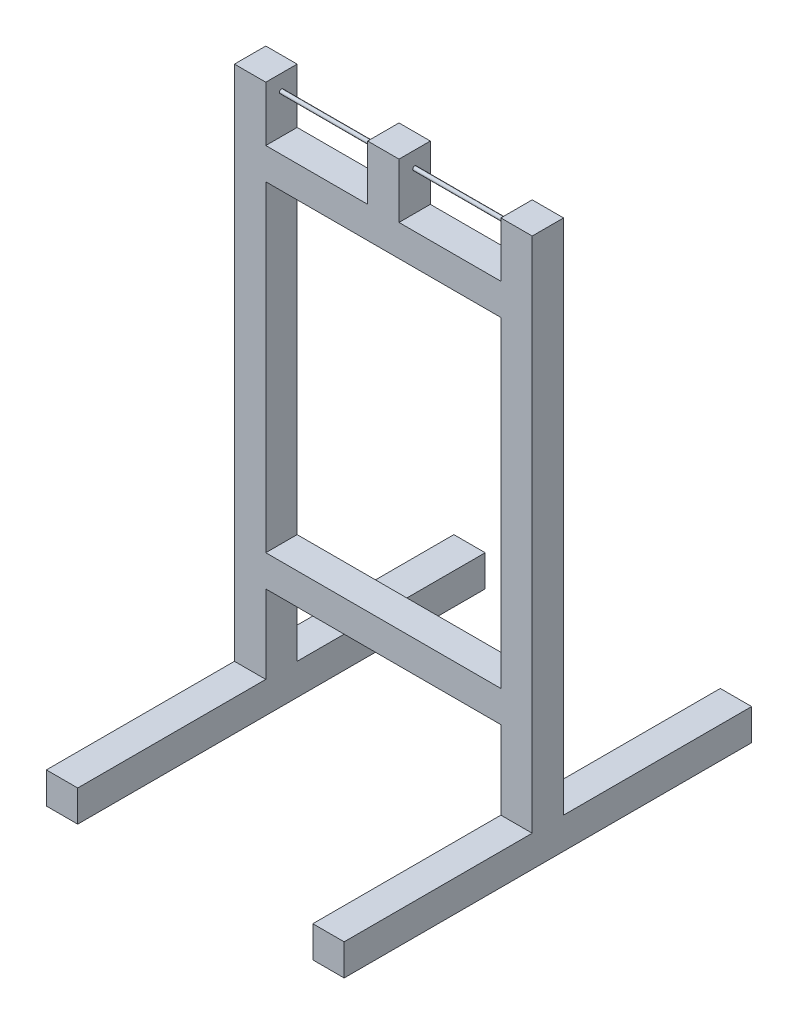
ISO-10303-21;
HEADER;
FILE_DESCRIPTION(('STEP AP214'),'2;1');
FILE_NAME('part.step','',(''),(''),'','','');
FILE_SCHEMA(('AUTOMOTIVE_DESIGN { 1 0 10303 214 1 1 1 1 }'));
ENDSEC;
DATA;
#1=APPLICATION_CONTEXT('core data for automotive mechanical design processes');
#2=APPLICATION_PROTOCOL_DEFINITION('international standard','automotive_design',2000,#1);
#3=PRODUCT_CONTEXT('',#1,'mechanical');
#4=PRODUCT('Part','Part','',(#3));
#5=PRODUCT_RELATED_PRODUCT_CATEGORY('part','',(#4));
#6=PRODUCT_DEFINITION_FORMATION('','',#4);
#7=PRODUCT_DEFINITION_CONTEXT('part definition',#1,'design');
#8=PRODUCT_DEFINITION('design','',#6,#7);
#9=PRODUCT_DEFINITION_SHAPE('','',#8);
#10=(LENGTH_UNIT() NAMED_UNIT(*) SI_UNIT(.MILLI.,.METRE.));
#11=(NAMED_UNIT(*) PLANE_ANGLE_UNIT() SI_UNIT($,.RADIAN.));
#12=(NAMED_UNIT(*) SI_UNIT($,.STERADIAN.) SOLID_ANGLE_UNIT());
#13=UNCERTAINTY_MEASURE_WITH_UNIT(LENGTH_MEASURE(1.E-05),#10,'distance_accuracy_value','');
#14=(GEOMETRIC_REPRESENTATION_CONTEXT(3) GLOBAL_UNCERTAINTY_ASSIGNED_CONTEXT((#13)) GLOBAL_UNIT_ASSIGNED_CONTEXT((#10,
#11,#12)) REPRESENTATION_CONTEXT('',''));
#15=CARTESIAN_POINT('',(0.,0.,0.));
#16=DIRECTION('',(0.,0.,1.));
#17=DIRECTION('',(1.,0.,0.));
#18=AXIS2_PLACEMENT_3D('',#15,#16,#17);
#19=CARTESIAN_POINT('',(500000.,387.35,165.1));
#20=DIRECTION('',(0.,-1.,0.));
#21=DIRECTION('',(0.,0.,-1.));
#22=AXIS2_PLACEMENT_3D('',#19,#20,#21);
#23=PLANE('',#22);
#24=DIRECTION('',(0.,0.,-1.));
#25=VECTOR('',#24,1.);
#26=CARTESIAN_POINT('',(120.65,387.35,12.7));
#27=LINE('',#26,#25);
#28=CARTESIAN_POINT('',(120.65,387.35,12.7));
#29=VERTEX_POINT('',#28);
#30=CARTESIAN_POINT('',(120.65,387.35,-12.7));
#31=VERTEX_POINT('',#30);
#32=EDGE_CURVE('E243',#29,#31,#27,.T.);
#33=ORIENTED_EDGE('',*,*,#32,.F.);
#34=DIRECTION('',(-1.,0.,0.));
#35=VECTOR('',#34,1.);
#36=CARTESIAN_POINT('',(500000.,387.35,12.7));
#37=LINE('',#36,#35);
#38=CARTESIAN_POINT('',(203.200000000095,387.35,12.7));
#39=VERTEX_POINT('',#38);
#40=EDGE_CURVE('E348',#39,#29,#37,.T.);
#41=ORIENTED_EDGE('',*,*,#40,.F.);
#42=DIRECTION('',(0.,0.,1.));
#43=VECTOR('',#42,1.);
#44=CARTESIAN_POINT('',(203.199999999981,387.35,165.1));
#45=LINE('',#44,#43);
#46=CARTESIAN_POINT('',(203.200000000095,387.35,-12.7));
#47=VERTEX_POINT('',#46);
#48=EDGE_CURVE('E356',#47,#39,#45,.T.);
#49=ORIENTED_EDGE('',*,*,#48,.F.);
#50=DIRECTION('',(-1.,0.,0.));
#51=VECTOR('',#50,1.);
#52=CARTESIAN_POINT('',(500000.,387.35,-12.7));
#53=LINE('',#52,#51);
#54=EDGE_CURVE('E344',#47,#31,#53,.T.);
#55=ORIENTED_EDGE('',*,*,#54,.T.);
#56=EDGE_LOOP('',(#33,#41,#49,#55));
#57=FACE_BOUND('',#56,.T.);
#58=ADVANCED_FACE('F33',(#57),#23,.F.);
#59=DIRECTION('',(0.,0.,1.));
#60=VECTOR('',#59,1.);
#61=CARTESIAN_POINT('',(95.25,387.35,12.7));
#62=LINE('',#61,#60);
#63=CARTESIAN_POINT('',(95.25,387.35,-12.7));
#64=VERTEX_POINT('',#63);
#65=CARTESIAN_POINT('',(95.2500000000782,387.35,12.7));
#66=VERTEX_POINT('',#65);
#67=EDGE_CURVE('E239',#64,#66,#62,.T.);
#68=ORIENTED_EDGE('',*,*,#67,.F.);
#69=CARTESIAN_POINT('',(12.7,387.35,-12.7));
#70=VERTEX_POINT('',#69);
#71=EDGE_CURVE('E347',#64,#70,#53,.T.);
#72=ORIENTED_EDGE('',*,*,#71,.T.);
#73=DIRECTION('',(0.,0.,1.));
#74=VECTOR('',#73,1.);
#75=CARTESIAN_POINT('',(12.7,387.35,165.1));
#76=LINE('',#75,#74);
#77=CARTESIAN_POINT('',(12.7,387.35,12.7));
#78=VERTEX_POINT('',#77);
#79=EDGE_CURVE('E336',#70,#78,#76,.T.);
#80=ORIENTED_EDGE('',*,*,#79,.T.);
#81=EDGE_CURVE('E346',#66,#78,#37,.T.);
#82=ORIENTED_EDGE('',*,*,#81,.F.);
#83=EDGE_LOOP('',(#68,#72,#80,#82));
#84=FACE_BOUND('',#83,.T.);
#85=ADVANCED_FACE('F448',(#84),#23,.F.);
#86=CARTESIAN_POINT('',(500000.,419.1,0.));
#87=DIRECTION('',(-1.,0.,0.));
#88=DIRECTION('',(0.,0.,1.));
#89=AXIS2_PLACEMENT_3D('',#86,#87,#88);
#90=CYLINDRICAL_SURFACE('',#89,1.5875);
#91=CARTESIAN_POINT('',(203.199999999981,419.1,0.));
#92=DIRECTION('',(1.,0.,0.));
#93=DIRECTION('',(0.,0.,-1.));
#94=AXIS2_PLACEMENT_3D('',#91,#92,#93);
#95=CIRCLE('',#94,1.5875);
#96=CARTESIAN_POINT('',(203.199999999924,419.1,1.5875));
#97=VERTEX_POINT('',#96);
#98=EDGE_CURVE('E426',#97,#97,#95,.F.);
#99=CARTESIAN_POINT('',(120.650000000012,419.1,0.));
#100=DIRECTION('',(-1.,0.,0.));
#101=DIRECTION('',(0.,0.,1.));
#102=AXIS2_PLACEMENT_3D('',#99,#100,#101);
#103=CIRCLE('',#102,1.5875);
#104=CARTESIAN_POINT('',(120.650000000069,419.1,1.5875));
#105=VERTEX_POINT('',#104);
#106=EDGE_CURVE('E11',#105,#105,#103,.T.);
#107=CARTESIAN_POINT('',(203.199999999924,419.1,1.5875));
#108=CARTESIAN_POINT('',(202.3401041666,419.1,1.5875));
#109=CARTESIAN_POINT('',(201.480208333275,419.1,1.5875));
#110=CARTESIAN_POINT('',(199.760416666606,419.1,1.5875));
#111=CARTESIAN_POINT('',(198.900520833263,419.1,1.5875));
#112=CARTESIAN_POINT('',(197.180729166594,419.1,1.5875));
#113=CARTESIAN_POINT('',(196.32083333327,419.1,1.5875));
#114=CARTESIAN_POINT('',(194.601041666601,419.1,1.5875));
#115=CARTESIAN_POINT('',(193.741145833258,419.1,1.5875));
#116=CARTESIAN_POINT('',(192.021354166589,419.1,1.5875));
#117=CARTESIAN_POINT('',(191.161458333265,419.1,1.5875));
#118=CARTESIAN_POINT('',(189.441666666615,419.1,1.5875));
#119=CARTESIAN_POINT('',(188.58177083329,419.1,1.5875));
#120=CARTESIAN_POINT('',(186.861979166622,419.1,1.5875));
#121=CARTESIAN_POINT('',(186.002083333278,419.1,1.5875));
#122=CARTESIAN_POINT('',(184.28229166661,419.1,1.5875));
#123=CARTESIAN_POINT('',(183.422395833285,419.1,1.5875));
#124=CARTESIAN_POINT('',(181.702604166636,419.1,1.5875));
#125=CARTESIAN_POINT('',(180.842708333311,419.1,1.5875));
#126=CARTESIAN_POINT('',(179.122916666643,419.1,1.5875));
#127=CARTESIAN_POINT('',(178.263020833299,419.1,1.5875));
#128=CARTESIAN_POINT('',(176.543229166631,419.1,1.5875));
#129=CARTESIAN_POINT('',(175.683333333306,419.1,1.5875));
#130=CARTESIAN_POINT('',(173.963541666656,419.1,1.5875));
#131=CARTESIAN_POINT('',(173.103645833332,419.1,1.5875));
#132=CARTESIAN_POINT('',(171.383854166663,419.1,1.5875));
#133=CARTESIAN_POINT('',(170.52395833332,419.1,1.5875));
#134=CARTESIAN_POINT('',(168.804166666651,419.1,1.5875));
#135=CARTESIAN_POINT('',(167.944270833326,419.1,1.5875));
#136=CARTESIAN_POINT('',(166.224479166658,419.1,1.5875));
#137=CARTESIAN_POINT('',(165.364583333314,419.1,1.5875));
#138=CARTESIAN_POINT('',(163.644791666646,419.1,1.5875));
#139=CARTESIAN_POINT('',(162.784895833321,419.1,1.5875));
#140=CARTESIAN_POINT('',(161.065104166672,419.1,1.5875));
#141=CARTESIAN_POINT('',(160.205208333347,419.1,1.5875));
#142=CARTESIAN_POINT('',(158.485416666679,419.1,1.5875));
#143=CARTESIAN_POINT('',(157.625520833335,419.1,1.5875));
#144=CARTESIAN_POINT('',(155.905729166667,419.1,1.5875));
#145=CARTESIAN_POINT('',(155.045833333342,419.1,1.5875));
#146=CARTESIAN_POINT('',(153.326041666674,419.1,1.5875));
#147=CARTESIAN_POINT('',(152.46614583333,419.1,1.5875));
#148=CARTESIAN_POINT('',(150.746354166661,419.1,1.5875));
#149=CARTESIAN_POINT('',(149.886458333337,419.1,1.5875));
#150=CARTESIAN_POINT('',(148.166666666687,419.1,1.5875));
#151=CARTESIAN_POINT('',(147.306770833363,419.1,1.5875));
#152=CARTESIAN_POINT('',(145.586979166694,419.1,1.5875));
#153=CARTESIAN_POINT('',(144.72708333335,419.1,1.5875));
#154=CARTESIAN_POINT('',(143.007291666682,419.1,1.5875));
#155=CARTESIAN_POINT('',(142.147395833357,419.1,1.5875));
#156=CARTESIAN_POINT('',(140.427604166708,419.1,1.5875));
#157=CARTESIAN_POINT('',(139.567708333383,419.1,1.5875));
#158=CARTESIAN_POINT('',(137.847916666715,419.1,1.5875));
#159=CARTESIAN_POINT('',(136.988020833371,419.1,1.5875));
#160=CARTESIAN_POINT('',(135.268229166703,419.1,1.5875));
#161=CARTESIAN_POINT('',(134.408333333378,419.1,1.5875));
#162=CARTESIAN_POINT('',(132.688541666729,419.1,1.5875));
#163=CARTESIAN_POINT('',(131.828645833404,419.1,1.5875));
#164=CARTESIAN_POINT('',(130.108854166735,419.1,1.5875));
#165=CARTESIAN_POINT('',(129.248958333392,419.1,1.5875));
#166=CARTESIAN_POINT('',(127.529166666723,419.1,1.5875));
#167=CARTESIAN_POINT('',(126.669270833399,419.1,1.5875));
#168=CARTESIAN_POINT('',(124.94947916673,419.1,1.5875));
#169=CARTESIAN_POINT('',(124.089583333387,419.1,1.5875));
#170=CARTESIAN_POINT('',(122.369791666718,419.1,1.5875));
#171=CARTESIAN_POINT('',(121.509895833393,419.1,1.5875));
#172=CARTESIAN_POINT('',(120.650000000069,419.1,1.5875));
#173=B_SPLINE_CURVE_WITH_KNOTS('',3,(#107,#108,#109,#110,#111,#112,#113,#114,#115,#116,#117,
#118,#119,#120,#121,#122,#123,#124,#125,#126,#127,#128,#129,#130,#131,#132,#133,#134,#135,#136,
#137,#138,#139,#140,#141,#142,#143,#144,#145,#146,#147,#148,#149,#150,#151,#152,#153,#154,#155,
#156,#157,#158,#159,#160,#161,#162,#163,#164,#165,#166,#167,#168,#169,#170,#171,#172),
.UNSPECIFIED.,.F.,.F.,(4,2,2,2,2,2,2,2,2,2,2,2,2,2,2,2,2,2,2,2,2,2,2,2,2,2,2,2,2,2,2,2,4),(0.,
2.57968749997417,5.15937500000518,7.73906249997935,10.3187500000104,12.8984374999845,
15.4781249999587,18.0578124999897,20.6374999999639,23.2171874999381,25.7968749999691,
28.3765624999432,30.9562499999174,33.5359374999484,36.1156249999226,38.6953124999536,
41.2749999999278,43.854687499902,46.434374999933,49.0140624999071,51.5937499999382,
54.1734374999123,56.7531249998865,59.3328124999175,61.9124999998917,64.4921874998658,
67.0718749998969,69.651562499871,72.2312499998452,74.8109374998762,77.3906249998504,
79.9703124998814,82.5499999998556),.UNSPECIFIED.);
#174=EDGE_CURVE('BSEAM437',#97,#105,#173,.T.);
#175=ORIENTED_EDGE('',*,*,#98,.T.);
#176=ORIENTED_EDGE('',*,*,#106,.F.);
#177=ORIENTED_EDGE('',*,*,#174,.T.);
#178=ORIENTED_EDGE('',*,*,#174,.F.);
#179=EDGE_LOOP('',(#175,#177,#176,#178));
#180=FACE_BOUND('',#179,.T.);
#181=ADVANCED_FACE('F437',(#180),#90,.T.);
#182=CARTESIAN_POINT('',(12.6999999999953,419.1,0.));
#183=DIRECTION('',(-1.,0.,0.));
#184=DIRECTION('',(0.,0.,1.));
#185=AXIS2_PLACEMENT_3D('',#182,#183,#184);
#186=CIRCLE('',#185,1.5875);
#187=CARTESIAN_POINT('',(12.6999999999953,419.1,1.5875));
#188=VERTEX_POINT('',#187);
#189=EDGE_CURVE('E423',#188,#188,#186,.F.);
#190=CARTESIAN_POINT('',(95.2500000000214,419.1,0.));
#191=DIRECTION('',(1.,0.,0.));
#192=DIRECTION('',(0.,0.,-1.));
#193=AXIS2_PLACEMENT_3D('',#190,#191,#192);
#194=CIRCLE('',#193,1.5875);
#195=CARTESIAN_POINT('',(95.2499999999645,419.1,1.5875));
#196=VERTEX_POINT('',#195);
#197=EDGE_CURVE('E41',#196,#196,#194,.T.);
#198=CARTESIAN_POINT('',(12.6999999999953,419.1,1.5875));
#199=CARTESIAN_POINT('',(13.55989583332,419.1,1.5875));
#200=CARTESIAN_POINT('',(14.4197916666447,419.1,1.5875));
#201=CARTESIAN_POINT('',(16.1395833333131,419.1,1.5875));
#202=CARTESIAN_POINT('',(16.9994791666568,419.1,1.5875));
#203=CARTESIAN_POINT('',(18.7192708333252,419.1,1.5875));
#204=CARTESIAN_POINT('',(19.5791666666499,419.1,1.5875));
#205=CARTESIAN_POINT('',(21.2989583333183,419.1,1.5875));
#206=CARTESIAN_POINT('',(22.158854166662,419.1,1.5875));
#207=CARTESIAN_POINT('',(23.8786458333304,419.1,1.5875));
#208=CARTESIAN_POINT('',(24.7385416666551,419.1,1.5875));
#209=CARTESIAN_POINT('',(26.4583333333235,419.1,1.5875));
#210=CARTESIAN_POINT('',(27.3182291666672,419.1,1.5875));
#211=CARTESIAN_POINT('',(29.0380208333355,419.1,1.5875));
#212=CARTESIAN_POINT('',(29.8979166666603,419.1,1.5875));
#213=CARTESIAN_POINT('',(31.6177083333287,419.1,1.5875));
#214=CARTESIAN_POINT('',(32.4776041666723,419.1,1.5875));
#215=CARTESIAN_POINT('',(34.1973958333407,419.1,1.5875));
#216=CARTESIAN_POINT('',(35.0572916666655,419.1,1.5875));
#217=CARTESIAN_POINT('',(36.7770833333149,419.1,1.5875));
#218=CARTESIAN_POINT('',(37.6369791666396,419.1,1.5875));
#219=CARTESIAN_POINT('',(39.356770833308,419.1,1.5875));
#220=CARTESIAN_POINT('',(40.2166666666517,419.1,1.5875));
#221=CARTESIAN_POINT('',(41.9364583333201,419.1,1.5875));
#222=CARTESIAN_POINT('',(42.7963541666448,419.1,1.5875));
#223=CARTESIAN_POINT('',(44.5161458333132,419.1,1.5875));
#224=CARTESIAN_POINT('',(45.3760416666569,419.1,1.5875));
#225=CARTESIAN_POINT('',(47.0958333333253,419.1,1.5875));
#226=CARTESIAN_POINT('',(47.95572916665,419.1,1.5875));
#227=CARTESIAN_POINT('',(49.6755208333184,419.1,1.5875));
#228=CARTESIAN_POINT('',(50.5354166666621,419.1,1.5875));
#229=CARTESIAN_POINT('',(52.2552083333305,419.1,1.5875));
#230=CARTESIAN_POINT('',(53.1151041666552,419.1,1.5875));
#231=CARTESIAN_POINT('',(54.8348958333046,419.1,1.5875));
#232=CARTESIAN_POINT('',(55.6947916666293,419.1,1.5875));
#233=CARTESIAN_POINT('',(57.4145833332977,419.1,1.5875));
#234=CARTESIAN_POINT('',(58.2744791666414,419.1,1.5875));
#235=CARTESIAN_POINT('',(59.9942708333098,419.1,1.5875));
#236=CARTESIAN_POINT('',(60.8541666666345,419.1,1.5875));
#237=CARTESIAN_POINT('',(62.5739583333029,419.1,1.5875));
#238=CARTESIAN_POINT('',(63.4338541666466,419.1,1.5875));
#239=CARTESIAN_POINT('',(65.153645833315,419.1,1.5875));
#240=CARTESIAN_POINT('',(66.0135416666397,419.1,1.5875));
#241=CARTESIAN_POINT('',(67.7333333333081,419.1,1.5875));
#242=CARTESIAN_POINT('',(68.5932291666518,419.1,1.5875));
#243=CARTESIAN_POINT('',(70.3130208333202,419.1,1.5875));
#244=CARTESIAN_POINT('',(71.1729166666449,419.1,1.5875));
#245=CARTESIAN_POINT('',(72.8927083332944,419.1,1.5875));
#246=CARTESIAN_POINT('',(73.7526041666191,419.1,1.5875));
#247=CARTESIAN_POINT('',(75.4723958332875,419.1,1.5875));
#248=CARTESIAN_POINT('',(76.3322916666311,419.1,1.5875));
#249=CARTESIAN_POINT('',(78.0520833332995,419.1,1.5875));
#250=CARTESIAN_POINT('',(78.9119791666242,419.1,1.5875));
#251=CARTESIAN_POINT('',(80.6317708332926,419.1,1.5875));
#252=CARTESIAN_POINT('',(81.4916666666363,419.1,1.5875));
#253=CARTESIAN_POINT('',(83.2114583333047,419.1,1.5875));
#254=CARTESIAN_POINT('',(84.0713541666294,419.1,1.5875));
#255=CARTESIAN_POINT('',(85.7911458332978,419.1,1.5875));
#256=CARTESIAN_POINT('',(86.6510416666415,419.1,1.5875));
#257=CARTESIAN_POINT('',(88.3708333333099,419.1,1.5875));
#258=CARTESIAN_POINT('',(89.2307291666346,419.1,1.5875));
#259=CARTESIAN_POINT('',(90.950520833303,419.1,1.5875));
#260=CARTESIAN_POINT('',(91.8104166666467,419.1,1.5875));
#261=CARTESIAN_POINT('',(93.5302083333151,419.1,1.5875));
#262=CARTESIAN_POINT('',(94.3901041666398,419.1,1.5875));
#263=CARTESIAN_POINT('',(95.2499999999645,419.1,1.5875));
#264=B_SPLINE_CURVE_WITH_KNOTS('',3,(#198,#199,#200,#201,#202,#203,#204,#205,#206,#207,#208,
#209,#210,#211,#212,#213,#214,#215,#216,#217,#218,#219,#220,#221,#222,#223,#224,#225,#226,#227,
#228,#229,#230,#231,#232,#233,#234,#235,#236,#237,#238,#239,#240,#241,#242,#243,#244,#245,#246,
#247,#248,#249,#250,#251,#252,#253,#254,#255,#256,#257,#258,#259,#260,#261,#262,#263),
.UNSPECIFIED.,.F.,.F.,(4,2,2,2,2,2,2,2,2,2,2,2,2,2,2,2,2,2,2,2,2,2,2,2,2,2,2,2,2,2,2,2,4),(0.,
2.57968749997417,5.15937500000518,7.73906249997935,10.3187500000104,12.8984374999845,
15.4781250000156,18.0578124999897,20.6375000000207,23.2171874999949,25.7968749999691,
28.3765625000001,30.9562499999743,33.5359375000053,36.1156249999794,38.6953125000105,
41.2749999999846,43.8546874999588,46.4343749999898,49.014062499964,51.593749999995,
54.1734374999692,56.7531250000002,59.3328124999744,61.9124999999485,64.4921874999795,
67.0718749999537,69.6515624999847,72.2312499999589,74.8109374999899,77.3906249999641,
79.9703124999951,82.5499999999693),.UNSPECIFIED.);
#265=EDGE_CURVE('BSEAM434',#188,#196,#264,.T.);
#266=ORIENTED_EDGE('',*,*,#189,.T.);
#267=ORIENTED_EDGE('',*,*,#197,.F.);
#268=ORIENTED_EDGE('',*,*,#265,.T.);
#269=ORIENTED_EDGE('',*,*,#265,.F.);
#270=EDGE_LOOP('',(#266,#268,#267,#269));
#271=FACE_BOUND('',#270,.T.);
#272=ADVANCED_FACE('F434',(#271),#90,.T.);
#273=CARTESIAN_POINT('',(203.2,-12.7,165.1));
#274=DIRECTION('',(1.,0.,0.));
#275=DIRECTION('',(0.,0.,-1.));
#276=AXIS2_PLACEMENT_3D('',#273,#274,#275);
#277=PLANE('',#276);
#278=DIRECTION('',(0.,0.,1.));
#279=VECTOR('',#278,1.);
#280=CARTESIAN_POINT('',(203.199999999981,101.6,165.1));
#281=LINE('',#280,#279);
#282=CARTESIAN_POINT('',(203.200000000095,101.6,-12.7));
#283=VERTEX_POINT('',#282);
#284=CARTESIAN_POINT('',(203.200000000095,101.6,12.7));
#285=VERTEX_POINT('',#284);
#286=EDGE_CURVE('E248',#283,#285,#281,.T.);
#287=ORIENTED_EDGE('',*,*,#286,.T.);
#288=DIRECTION('',(0.,-1.,0.));
#289=VECTOR('',#288,1.);
#290=CARTESIAN_POINT('',(203.2,431.8,12.7));
#291=LINE('',#290,#289);
#292=CARTESIAN_POINT('',(203.200000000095,361.95,12.7));
#293=VERTEX_POINT('',#292);
#294=EDGE_CURVE('E377',#293,#285,#291,.T.);
#295=ORIENTED_EDGE('',*,*,#294,.F.);
#296=DIRECTION('',(0.,0.,-1.));
#297=VECTOR('',#296,1.);
#298=CARTESIAN_POINT('',(203.199999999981,361.95,165.1));
#299=LINE('',#298,#297);
#300=CARTESIAN_POINT('',(203.2,361.95,-12.7));
#301=VERTEX_POINT('',#300);
#302=EDGE_CURVE('E335',#293,#301,#299,.T.);
#303=ORIENTED_EDGE('',*,*,#302,.T.);
#304=DIRECTION('',(0.,-1.,0.));
#305=VECTOR('',#304,1.);
#306=CARTESIAN_POINT('',(203.2,431.8,-12.7));
#307=LINE('',#306,#305);
#308=EDGE_CURVE('E382',#301,#283,#307,.T.);
#309=ORIENTED_EDGE('',*,*,#308,.T.);
#310=EDGE_LOOP('',(#287,#295,#303,#309));
#311=FACE_BOUND('',#310,.T.);
#312=ADVANCED_FACE('F436',(#311),#277,.F.);
#313=DIRECTION('',(0.,0.,-1.));
#314=VECTOR('',#313,1.);
#315=CARTESIAN_POINT('',(203.199999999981,76.2,165.1));
#316=LINE('',#315,#314);
#317=CARTESIAN_POINT('',(203.2,76.2,12.7));
#318=VERTEX_POINT('',#317);
#319=CARTESIAN_POINT('',(203.200000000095,76.2,-12.7));
#320=VERTEX_POINT('',#319);
#321=EDGE_CURVE('E245',#318,#320,#316,.T.);
#322=ORIENTED_EDGE('',*,*,#321,.T.);
#323=CARTESIAN_POINT('',(203.2,12.7,-12.7));
#324=VERTEX_POINT('',#323);
#325=EDGE_CURVE('E376',#320,#324,#307,.T.);
#326=ORIENTED_EDGE('',*,*,#325,.T.);
#327=DIRECTION('',(0.,0.,-1.));
#328=VECTOR('',#327,1.);
#329=CARTESIAN_POINT('',(203.2,12.7,165.1));
#330=LINE('',#329,#328);
#331=CARTESIAN_POINT('',(203.2,12.7,-165.1));
#332=VERTEX_POINT('',#331);
#333=EDGE_CURVE('E416',#324,#332,#330,.T.);
#334=ORIENTED_EDGE('',*,*,#333,.T.);
#335=DIRECTION('',(0.,-1.,0.));
#336=VECTOR('',#335,1.);
#337=CARTESIAN_POINT('',(203.2,-12.7,-165.1));
#338=LINE('',#337,#336);
#339=CARTESIAN_POINT('',(203.2,-12.7,-165.1));
#340=VERTEX_POINT('',#339);
#341=EDGE_CURVE('E408',#332,#340,#338,.T.);
#342=ORIENTED_EDGE('',*,*,#341,.T.);
#343=DIRECTION('',(0.,0.,-1.));
#344=VECTOR('',#343,1.);
#345=CARTESIAN_POINT('',(203.2,-12.7,165.1));
#346=LINE('',#345,#344);
#347=CARTESIAN_POINT('',(203.2,-12.7,165.1));
#348=VERTEX_POINT('',#347);
#349=EDGE_CURVE('E413',#348,#340,#346,.T.);
#350=ORIENTED_EDGE('',*,*,#349,.F.);
#351=DIRECTION('',(0.,-1.,0.));
#352=VECTOR('',#351,1.);
#353=CARTESIAN_POINT('',(203.2,-12.7,165.1));
#354=LINE('',#353,#352);
#355=CARTESIAN_POINT('',(203.2,12.7,165.1));
#356=VERTEX_POINT('',#355);
#357=EDGE_CURVE('E398',#356,#348,#354,.T.);
#358=ORIENTED_EDGE('',*,*,#357,.F.);
#359=CARTESIAN_POINT('',(203.2,12.7,12.7));
#360=VERTEX_POINT('',#359);
#361=EDGE_CURVE('E417',#356,#360,#330,.T.);
#362=ORIENTED_EDGE('',*,*,#361,.T.);
#363=EDGE_CURVE('E372',#318,#360,#291,.T.);
#364=ORIENTED_EDGE('',*,*,#363,.F.);
#365=EDGE_LOOP('',(#322,#326,#334,#342,#350,#358,#362,#364));
#366=FACE_BOUND('',#365,.T.);
#367=ADVANCED_FACE('F444',(#366),#277,.F.);
#368=ORIENTED_EDGE('',*,*,#98,.F.);
#369=EDGE_LOOP('',(#368));
#370=FACE_BOUND('',#369,.T.);
#371=CARTESIAN_POINT('',(203.2,431.8,-12.7));
#372=VERTEX_POINT('',#371);
#373=EDGE_CURVE('E378',#372,#47,#307,.T.);
#374=ORIENTED_EDGE('',*,*,#373,.T.);
#375=ORIENTED_EDGE('',*,*,#48,.T.);
#376=CARTESIAN_POINT('',(203.2,431.8,12.7));
#377=VERTEX_POINT('',#376);
#378=EDGE_CURVE('E373',#377,#39,#291,.T.);
#379=ORIENTED_EDGE('',*,*,#378,.F.);
#380=DIRECTION('',(0.,0.,1.));
#381=VECTOR('',#380,1.);
#382=CARTESIAN_POINT('',(203.2,431.8,12.7));
#383=LINE('',#382,#381);
#384=EDGE_CURVE('E365',#372,#377,#383,.T.);
#385=ORIENTED_EDGE('',*,*,#384,.F.);
#386=EDGE_LOOP('',(#374,#375,#379,#385));
#387=FACE_BOUND('',#386,.T.);
#388=ADVANCED_FACE('F447',(#370,#387),#277,.F.);
#389=CARTESIAN_POINT('',(203.2,12.7,165.1));
#390=DIRECTION('',(0.,-1.,0.));
#391=DIRECTION('',(0.,0.,-1.));
#392=AXIS2_PLACEMENT_3D('',#389,#390,#391);
#393=PLANE('',#392);
#394=DIRECTION('',(-1.,0.,0.));
#395=VECTOR('',#394,1.);
#396=CARTESIAN_POINT('',(203.2,12.7,-12.7));
#397=LINE('',#396,#395);
#398=CARTESIAN_POINT('',(228.6,12.7,-12.7));
#399=VERTEX_POINT('',#398);
#400=EDGE_CURVE('E388',#399,#324,#397,.T.);
#401=ORIENTED_EDGE('',*,*,#400,.F.);
#402=DIRECTION('',(0.,0.,-1.));
#403=VECTOR('',#402,1.);
#404=CARTESIAN_POINT('',(228.6,12.7,165.1));
#405=LINE('',#404,#403);
#406=CARTESIAN_POINT('',(228.6,12.7,-165.1));
#407=VERTEX_POINT('',#406);
#408=EDGE_CURVE('E420',#399,#407,#405,.T.);
#409=ORIENTED_EDGE('',*,*,#408,.T.);
#410=DIRECTION('',(-1.,0.,0.));
#411=VECTOR('',#410,1.);
#412=CARTESIAN_POINT('',(203.2,12.7,-165.1));
#413=LINE('',#412,#411);
#414=EDGE_CURVE('E405',#407,#332,#413,.T.);
#415=ORIENTED_EDGE('',*,*,#414,.T.);
#416=ORIENTED_EDGE('',*,*,#333,.F.);
#417=EDGE_LOOP('',(#401,#409,#415,#416));
#418=FACE_BOUND('',#417,.T.);
#419=ADVANCED_FACE('F488',(#418),#393,.F.);
#420=DIRECTION('',(1.,0.,0.));
#421=VECTOR('',#420,1.);
#422=CARTESIAN_POINT('',(203.2,12.7,12.7));
#423=LINE('',#422,#421);
#424=CARTESIAN_POINT('',(228.6,12.7,12.7));
#425=VERTEX_POINT('',#424);
#426=EDGE_CURVE('E385',#360,#425,#423,.T.);
#427=ORIENTED_EDGE('',*,*,#426,.F.);
#428=ORIENTED_EDGE('',*,*,#361,.F.);
#429=DIRECTION('',(-1.,0.,0.));
#430=VECTOR('',#429,1.);
#431=CARTESIAN_POINT('',(203.2,12.7,165.1));
#432=LINE('',#431,#430);
#433=CARTESIAN_POINT('',(228.6,12.7,165.1));
#434=VERTEX_POINT('',#433);
#435=EDGE_CURVE('E395',#434,#356,#432,.T.);
#436=ORIENTED_EDGE('',*,*,#435,.F.);
#437=EDGE_CURVE('E421',#434,#425,#405,.T.);
#438=ORIENTED_EDGE('',*,*,#437,.T.);
#439=EDGE_LOOP('',(#427,#428,#436,#438));
#440=FACE_BOUND('',#439,.T.);
#441=ADVANCED_FACE('F490',(#440),#393,.F.);
#442=CARTESIAN_POINT('',(228.6,-12.7,165.1));
#443=DIRECTION('',(-1.,0.,0.));
#444=DIRECTION('',(0.,0.,1.));
#445=AXIS2_PLACEMENT_3D('',#442,#443,#444);
#446=PLANE('',#445);
#447=ORIENTED_EDGE('',*,*,#408,.F.);
#448=DIRECTION('',(0.,-1.,0.));
#449=VECTOR('',#448,1.);
#450=CARTESIAN_POINT('',(228.6,431.8,-12.7));
#451=LINE('',#450,#449);
#452=CARTESIAN_POINT('',(228.6,431.8,-12.7));
#453=VERTEX_POINT('',#452);
#454=EDGE_CURVE('E381',#453,#399,#451,.T.);
#455=ORIENTED_EDGE('',*,*,#454,.F.);
#456=DIRECTION('',(0.,0.,-1.));
#457=VECTOR('',#456,1.);
#458=CARTESIAN_POINT('',(228.6,431.8,12.7));
#459=LINE('',#458,#457);
#460=CARTESIAN_POINT('',(228.6,431.8,12.7));
#461=VERTEX_POINT('',#460);
#462=EDGE_CURVE('E339',#461,#453,#459,.T.);
#463=ORIENTED_EDGE('',*,*,#462,.F.);
#464=DIRECTION('',(0.,-1.,0.));
#465=VECTOR('',#464,1.);
#466=CARTESIAN_POINT('',(228.6,431.8,12.7));
#467=LINE('',#466,#465);
#468=EDGE_CURVE('E369',#461,#425,#467,.T.);
#469=ORIENTED_EDGE('',*,*,#468,.T.);
#470=ORIENTED_EDGE('',*,*,#437,.F.);
#471=DIRECTION('',(0.,1.,0.));
#472=VECTOR('',#471,1.);
#473=CARTESIAN_POINT('',(228.6,-12.7,165.1));
#474=LINE('',#473,#472);
#475=CARTESIAN_POINT('',(228.6,-12.7,165.1));
#476=VERTEX_POINT('',#475);
#477=EDGE_CURVE('E392',#476,#434,#474,.T.);
#478=ORIENTED_EDGE('',*,*,#477,.F.);
#479=DIRECTION('',(0.,0.,-1.));
#480=VECTOR('',#479,1.);
#481=CARTESIAN_POINT('',(228.6,-12.7,165.1));
#482=LINE('',#481,#480);
#483=CARTESIAN_POINT('',(228.6,-12.7,-165.1));
#484=VERTEX_POINT('',#483);
#485=EDGE_CURVE('E402',#476,#484,#482,.T.);
#486=ORIENTED_EDGE('',*,*,#485,.T.);
#487=DIRECTION('',(0.,1.,0.));
#488=VECTOR('',#487,1.);
#489=CARTESIAN_POINT('',(228.6,-12.7,-165.1));
#490=LINE('',#489,#488);
#491=EDGE_CURVE('E391',#484,#407,#490,.T.);
#492=ORIENTED_EDGE('',*,*,#491,.T.);
#493=EDGE_LOOP('',(#447,#455,#463,#469,#470,#478,#486,#492));
#494=FACE_BOUND('',#493,.T.);
#495=ADVANCED_FACE('F35',(#494),#446,.F.);
#496=CARTESIAN_POINT('',(203.2,-12.7,165.1));
#497=DIRECTION('',(0.,1.,0.));
#498=DIRECTION('',(0.,0.,1.));
#499=AXIS2_PLACEMENT_3D('',#496,#497,#498);
#500=PLANE('',#499);
#501=DIRECTION('',(1.,0.,0.));
#502=VECTOR('',#501,1.);
#503=CARTESIAN_POINT('',(203.2,-12.7,-165.1));
#504=LINE('',#503,#502);
#505=EDGE_CURVE('E396',#340,#484,#504,.T.);
#506=ORIENTED_EDGE('',*,*,#505,.T.);
#507=ORIENTED_EDGE('',*,*,#485,.F.);
#508=DIRECTION('',(1.,0.,0.));
#509=VECTOR('',#508,1.);
#510=CARTESIAN_POINT('',(203.2,-12.7,165.1));
#511=LINE('',#510,#509);
#512=EDGE_CURVE('E400',#348,#476,#511,.T.);
#513=ORIENTED_EDGE('',*,*,#512,.F.);
#514=ORIENTED_EDGE('',*,*,#349,.T.);
#515=EDGE_LOOP('',(#506,#507,#513,#514));
#516=FACE_BOUND('',#515,.T.);
#517=ADVANCED_FACE('F481',(#516),#500,.F.);
#518=CARTESIAN_POINT('',(215.9,0.,165.1));
#519=DIRECTION('',(0.,0.,-1.));
#520=DIRECTION('',(-1.,0.,0.));
#521=AXIS2_PLACEMENT_3D('',#518,#519,#520);
#522=PLANE('',#521);
#523=ORIENTED_EDGE('',*,*,#477,.T.);
#524=ORIENTED_EDGE('',*,*,#435,.T.);
#525=ORIENTED_EDGE('',*,*,#357,.T.);
#526=ORIENTED_EDGE('',*,*,#512,.T.);
#527=EDGE_LOOP('',(#523,#524,#525,#526));
#528=FACE_BOUND('',#527,.T.);
#529=ADVANCED_FACE('F478',(#528),#522,.F.);
#530=CARTESIAN_POINT('',(215.9,0.,-165.1));
#531=DIRECTION('',(0.,0.,-1.));
#532=DIRECTION('',(-1.,0.,0.));
#533=AXIS2_PLACEMENT_3D('',#530,#531,#532);
#534=PLANE('',#533);
#535=ORIENTED_EDGE('',*,*,#491,.F.);
#536=ORIENTED_EDGE('',*,*,#505,.F.);
#537=ORIENTED_EDGE('',*,*,#341,.F.);
#538=ORIENTED_EDGE('',*,*,#414,.F.);
#539=EDGE_LOOP('',(#535,#536,#537,#538));
#540=FACE_BOUND('',#539,.T.);
#541=ADVANCED_FACE('F477',(#540),#534,.T.);
#542=CARTESIAN_POINT('',(203.2,431.8,-12.7));
#543=DIRECTION('',(0.,0.,1.));
#544=DIRECTION('',(1.,0.,0.));
#545=AXIS2_PLACEMENT_3D('',#542,#543,#544);
#546=PLANE('',#545);
#547=ORIENTED_EDGE('',*,*,#325,.F.);
#548=DIRECTION('',(-1.,0.,0.));
#549=VECTOR('',#548,1.);
#550=CARTESIAN_POINT('',(500000.,76.2,-12.7));
#551=LINE('',#550,#549);
#552=CARTESIAN_POINT('',(12.7,76.2,-12.7));
#553=VERTEX_POINT('',#552);
#554=EDGE_CURVE('E260',#320,#553,#551,.T.);
#555=ORIENTED_EDGE('',*,*,#554,.T.);
#556=DIRECTION('',(0.,-1.,0.));
#557=VECTOR('',#556,1.);
#558=CARTESIAN_POINT('',(12.7,431.8,-12.7));
#559=LINE('',#558,#557);
#560=CARTESIAN_POINT('',(12.7,12.7,-12.7));
#561=VERTEX_POINT('',#560);
#562=EDGE_CURVE('E291',#553,#561,#559,.T.);
#563=ORIENTED_EDGE('',*,*,#562,.T.);
#564=DIRECTION('',(-1.,0.,0.));
#565=VECTOR('',#564,1.);
#566=CARTESIAN_POINT('',(-12.7,12.7,-12.7));
#567=LINE('',#566,#565);
#568=CARTESIAN_POINT('',(-12.7,12.7,-12.7));
#569=VERTEX_POINT('',#568);
#570=EDGE_CURVE('E299',#561,#569,#567,.T.);
#571=ORIENTED_EDGE('',*,*,#570,.T.);
#572=DIRECTION('',(0.,-1.,0.));
#573=VECTOR('',#572,1.);
#574=CARTESIAN_POINT('',(-12.7,431.8,-12.7));
#575=LINE('',#574,#573);
#576=CARTESIAN_POINT('',(-12.7,431.8,-12.7));
#577=VERTEX_POINT('',#576);
#578=EDGE_CURVE('E288',#577,#569,#575,.T.);
#579=ORIENTED_EDGE('',*,*,#578,.F.);
#580=DIRECTION('',(-1.,0.,0.));
#581=VECTOR('',#580,1.);
#582=CARTESIAN_POINT('',(-12.7,431.8,-12.7));
#583=LINE('',#582,#581);
#584=CARTESIAN_POINT('',(12.7,431.8,-12.7));
#585=VERTEX_POINT('',#584);
#586=EDGE_CURVE('E274',#585,#577,#583,.T.);
#587=ORIENTED_EDGE('',*,*,#586,.F.);
#588=EDGE_CURVE('E292',#585,#70,#559,.T.);
#589=ORIENTED_EDGE('',*,*,#588,.T.);
#590=ORIENTED_EDGE('',*,*,#71,.F.);
#591=DIRECTION('',(0.,-1.,0.));
#592=VECTOR('',#591,1.);
#593=CARTESIAN_POINT('',(95.25,431.8,-12.7));
#594=LINE('',#593,#592);
#595=CARTESIAN_POINT('',(95.25,431.8,-12.7));
#596=VERTEX_POINT('',#595);
#597=EDGE_CURVE('E228',#596,#64,#594,.T.);
#598=ORIENTED_EDGE('',*,*,#597,.F.);
#599=DIRECTION('',(-1.,0.,0.));
#600=VECTOR('',#599,1.);
#601=CARTESIAN_POINT('',(95.25,431.8,-12.7));
#602=LINE('',#601,#600);
#603=CARTESIAN_POINT('',(120.65,431.8,-12.7));
#604=VERTEX_POINT('',#603);
#605=EDGE_CURVE('E218',#604,#596,#602,.T.);
#606=ORIENTED_EDGE('',*,*,#605,.F.);
#607=DIRECTION('',(0.,-1.,0.));
#608=VECTOR('',#607,1.);
#609=CARTESIAN_POINT('',(120.65,431.8,-12.7));
#610=LINE('',#609,#608);
#611=EDGE_CURVE('E225',#604,#31,#610,.T.);
#612=ORIENTED_EDGE('',*,*,#611,.T.);
#613=ORIENTED_EDGE('',*,*,#54,.F.);
#614=ORIENTED_EDGE('',*,*,#373,.F.);
#615=DIRECTION('',(-1.,0.,0.));
#616=VECTOR('',#615,1.);
#617=CARTESIAN_POINT('',(203.2,431.8,-12.7));
#618=LINE('',#617,#616);
#619=EDGE_CURVE('E363',#453,#372,#618,.T.);
#620=ORIENTED_EDGE('',*,*,#619,.F.);
#621=ORIENTED_EDGE('',*,*,#454,.T.);
#622=ORIENTED_EDGE('',*,*,#400,.T.);
#623=EDGE_LOOP('',(#547,#555,#563,#571,#579,#587,#589,#590,#598,#606,#612,#613,#614,#620,#621,#622));
#624=FACE_BOUND('',#623,.T.);
#625=DIRECTION('',(-1.,0.,0.));
#626=VECTOR('',#625,1.);
#627=CARTESIAN_POINT('',(500000.,101.6,-12.7));
#628=LINE('',#627,#626);
#629=CARTESIAN_POINT('',(12.7,101.6,-12.7));
#630=VERTEX_POINT('',#629);
#631=EDGE_CURVE('E261',#283,#630,#628,.T.);
#632=ORIENTED_EDGE('',*,*,#631,.F.);
#633=ORIENTED_EDGE('',*,*,#308,.F.);
#634=DIRECTION('',(-1.,0.,0.));
#635=VECTOR('',#634,1.);
#636=CARTESIAN_POINT('',(500000.,361.95,-12.7));
#637=LINE('',#636,#635);
#638=CARTESIAN_POINT('',(12.7,361.95,-12.7));
#639=VERTEX_POINT('',#638);
#640=EDGE_CURVE('E343',#301,#639,#637,.T.);
#641=ORIENTED_EDGE('',*,*,#640,.T.);
#642=EDGE_CURVE('E296',#639,#630,#559,.T.);
#643=ORIENTED_EDGE('',*,*,#642,.T.);
#644=EDGE_LOOP('',(#632,#633,#641,#643));
#645=FACE_BOUND('',#644,.T.);
#646=ADVANCED_FACE('F221',(#624,#645),#546,.F.);
#647=CARTESIAN_POINT('',(203.2,431.8,12.7));
#648=DIRECTION('',(0.,0.,-1.));
#649=DIRECTION('',(-1.,0.,0.));
#650=AXIS2_PLACEMENT_3D('',#647,#648,#649);
#651=PLANE('',#650);
#652=DIRECTION('',(-1.,0.,0.));
#653=VECTOR('',#652,1.);
#654=CARTESIAN_POINT('',(500000.,76.2,12.7));
#655=LINE('',#654,#653);
#656=CARTESIAN_POINT('',(12.7,76.2,12.7));
#657=VERTEX_POINT('',#656);
#658=EDGE_CURVE('E55',#318,#657,#655,.T.);
#659=ORIENTED_EDGE('',*,*,#658,.F.);
#660=ORIENTED_EDGE('',*,*,#363,.T.);
#661=ORIENTED_EDGE('',*,*,#426,.T.);
#662=ORIENTED_EDGE('',*,*,#468,.F.);
#663=DIRECTION('',(1.,0.,0.));
#664=VECTOR('',#663,1.);
#665=CARTESIAN_POINT('',(203.2,431.8,12.7));
#666=LINE('',#665,#664);
#667=EDGE_CURVE('E367',#377,#461,#666,.T.);
#668=ORIENTED_EDGE('',*,*,#667,.F.);
#669=ORIENTED_EDGE('',*,*,#378,.T.);
#670=ORIENTED_EDGE('',*,*,#40,.T.);
#671=DIRECTION('',(0.,-1.,0.));
#672=VECTOR('',#671,1.);
#673=CARTESIAN_POINT('',(120.65,431.8,12.7));
#674=LINE('',#673,#672);
#675=CARTESIAN_POINT('',(120.65,431.8,12.7));
#676=VERTEX_POINT('',#675);
#677=EDGE_CURVE('E576',#676,#29,#674,.T.);
#678=ORIENTED_EDGE('',*,*,#677,.F.);
#679=DIRECTION('',(1.,0.,0.));
#680=VECTOR('',#679,1.);
#681=CARTESIAN_POINT('',(95.25,431.8,12.7));
#682=LINE('',#681,#680);
#683=CARTESIAN_POINT('',(95.25,431.8,12.7));
#684=VERTEX_POINT('',#683);
#685=EDGE_CURVE('E236',#684,#676,#682,.T.);
#686=ORIENTED_EDGE('',*,*,#685,.F.);
#687=DIRECTION('',(0.,-1.,0.));
#688=VECTOR('',#687,1.);
#689=CARTESIAN_POINT('',(95.25,431.8,12.7));
#690=LINE('',#689,#688);
#691=EDGE_CURVE('E48',#684,#66,#690,.T.);
#692=ORIENTED_EDGE('',*,*,#691,.T.);
#693=ORIENTED_EDGE('',*,*,#81,.T.);
#694=DIRECTION('',(0.,-1.,0.));
#695=VECTOR('',#694,1.);
#696=CARTESIAN_POINT('',(12.7,431.8,12.7));
#697=LINE('',#696,#695);
#698=CARTESIAN_POINT('',(12.7,431.8,12.7));
#699=VERTEX_POINT('',#698);
#700=EDGE_CURVE('E281',#699,#78,#697,.T.);
#701=ORIENTED_EDGE('',*,*,#700,.F.);
#702=DIRECTION('',(1.,0.,0.));
#703=VECTOR('',#702,1.);
#704=CARTESIAN_POINT('',(-12.7,431.8,12.7));
#705=LINE('',#704,#703);
#706=CARTESIAN_POINT('',(-12.7,431.8,12.7));
#707=VERTEX_POINT('',#706);
#708=EDGE_CURVE('E278',#707,#699,#705,.T.);
#709=ORIENTED_EDGE('',*,*,#708,.F.);
#710=DIRECTION('',(0.,-1.,0.));
#711=VECTOR('',#710,1.);
#712=CARTESIAN_POINT('',(-12.7,431.8,12.7));
#713=LINE('',#712,#711);
#714=CARTESIAN_POINT('',(-12.7,12.7,12.7));
#715=VERTEX_POINT('',#714);
#716=EDGE_CURVE('E284',#707,#715,#713,.T.);
#717=ORIENTED_EDGE('',*,*,#716,.T.);
#718=DIRECTION('',(1.,0.,0.));
#719=VECTOR('',#718,1.);
#720=CARTESIAN_POINT('',(-12.7,12.7,12.7));
#721=LINE('',#720,#719);
#722=CARTESIAN_POINT('',(12.7,12.7,12.7));
#723=VERTEX_POINT('',#722);
#724=EDGE_CURVE('E295',#715,#723,#721,.T.);
#725=ORIENTED_EDGE('',*,*,#724,.T.);
#726=EDGE_CURVE('E280',#657,#723,#697,.T.);
#727=ORIENTED_EDGE('',*,*,#726,.F.);
#728=EDGE_LOOP('',(#659,#660,#661,#662,#668,#669,#670,#678,#686,#692,#693,#701,#709,#717,#725,#727));
#729=FACE_BOUND('',#728,.T.);
#730=ORIENTED_EDGE('',*,*,#294,.T.);
#731=DIRECTION('',(-1.,0.,0.));
#732=VECTOR('',#731,1.);
#733=CARTESIAN_POINT('',(500000.,101.6,12.7));
#734=LINE('',#733,#732);
#735=CARTESIAN_POINT('',(12.7,101.6,12.7));
#736=VERTEX_POINT('',#735);
#737=EDGE_CURVE('E264',#285,#736,#734,.T.);
#738=ORIENTED_EDGE('',*,*,#737,.T.);
#739=CARTESIAN_POINT('',(12.7,361.95,12.7));
#740=VERTEX_POINT('',#739);
#741=EDGE_CURVE('E285',#740,#736,#697,.T.);
#742=ORIENTED_EDGE('',*,*,#741,.F.);
#743=DIRECTION('',(-1.,0.,0.));
#744=VECTOR('',#743,1.);
#745=CARTESIAN_POINT('',(500000.,361.95,12.7));
#746=LINE('',#745,#744);
#747=EDGE_CURVE('E351',#293,#740,#746,.T.);
#748=ORIENTED_EDGE('',*,*,#747,.F.);
#749=EDGE_LOOP('',(#730,#738,#742,#748));
#750=FACE_BOUND('',#749,.T.);
#751=ADVANCED_FACE('F471',(#729,#750),#651,.F.);
#752=CARTESIAN_POINT('',(215.9,431.8,0.));
#753=DIRECTION('',(0.,-1.,0.));
#754=DIRECTION('',(0.,0.,-1.));
#755=AXIS2_PLACEMENT_3D('',#752,#753,#754);
#756=PLANE('',#755);
#757=ORIENTED_EDGE('',*,*,#462,.T.);
#758=ORIENTED_EDGE('',*,*,#619,.T.);
#759=ORIENTED_EDGE('',*,*,#384,.T.);
#760=ORIENTED_EDGE('',*,*,#667,.T.);
#761=EDGE_LOOP('',(#757,#758,#759,#760));
#762=FACE_BOUND('',#761,.T.);
#763=ADVANCED_FACE('F467',(#762),#756,.F.);
#764=CARTESIAN_POINT('',(500000.,361.95,165.1));
#765=DIRECTION('',(0.,1.,0.));
#766=DIRECTION('',(0.,0.,1.));
#767=AXIS2_PLACEMENT_3D('',#764,#765,#766);
#768=PLANE('',#767);
#769=ORIENTED_EDGE('',*,*,#302,.F.);
#770=ORIENTED_EDGE('',*,*,#747,.T.);
#771=DIRECTION('',(0.,0.,-1.));
#772=VECTOR('',#771,1.);
#773=CARTESIAN_POINT('',(12.7,361.95,165.1));
#774=LINE('',#773,#772);
#775=EDGE_CURVE('E340',#740,#639,#774,.T.);
#776=ORIENTED_EDGE('',*,*,#775,.T.);
#777=ORIENTED_EDGE('',*,*,#640,.F.);
#778=EDGE_LOOP('',(#769,#770,#776,#777));
#779=FACE_BOUND('',#778,.T.);
#780=ADVANCED_FACE('F463',(#779),#768,.F.);
#781=CARTESIAN_POINT('',(12.7,-12.7,165.1));
#782=DIRECTION('',(-1.,0.,0.));
#783=DIRECTION('',(0.,0.,1.));
#784=AXIS2_PLACEMENT_3D('',#781,#782,#783);
#785=PLANE('',#784);
#786=ORIENTED_EDGE('',*,*,#189,.F.);
#787=EDGE_LOOP('',(#786));
#788=FACE_BOUND('',#787,.T.);
#789=ORIENTED_EDGE('',*,*,#700,.T.);
#790=ORIENTED_EDGE('',*,*,#79,.F.);
#791=ORIENTED_EDGE('',*,*,#588,.F.);
#792=DIRECTION('',(0.,0.,-1.));
#793=VECTOR('',#792,1.);
#794=CARTESIAN_POINT('',(12.7,431.8,12.7));
#795=LINE('',#794,#793);
#796=EDGE_CURVE('E256',#699,#585,#795,.T.);
#797=ORIENTED_EDGE('',*,*,#796,.F.);
#798=EDGE_LOOP('',(#789,#790,#791,#797));
#799=FACE_BOUND('',#798,.T.);
#800=ADVANCED_FACE('F466',(#788,#799),#785,.F.);
#801=ORIENTED_EDGE('',*,*,#642,.F.);
#802=ORIENTED_EDGE('',*,*,#775,.F.);
#803=ORIENTED_EDGE('',*,*,#741,.T.);
#804=DIRECTION('',(0.,0.,1.));
#805=VECTOR('',#804,1.);
#806=CARTESIAN_POINT('',(12.7,101.6,165.1));
#807=LINE('',#806,#805);
#808=EDGE_CURVE('E253',#630,#736,#807,.T.);
#809=ORIENTED_EDGE('',*,*,#808,.F.);
#810=EDGE_LOOP('',(#801,#802,#803,#809));
#811=FACE_BOUND('',#810,.T.);
#812=ADVANCED_FACE('F533',(#811),#785,.F.);
#813=DIRECTION('',(0.,0.,-1.));
#814=VECTOR('',#813,1.);
#815=CARTESIAN_POINT('',(12.7,76.2,165.1));
#816=LINE('',#815,#814);
#817=EDGE_CURVE('E257',#657,#553,#816,.T.);
#818=ORIENTED_EDGE('',*,*,#817,.F.);
#819=ORIENTED_EDGE('',*,*,#726,.T.);
#820=DIRECTION('',(0.,0.,-1.));
#821=VECTOR('',#820,1.);
#822=CARTESIAN_POINT('',(12.7,12.7,165.1));
#823=LINE('',#822,#821);
#824=CARTESIAN_POINT('',(12.7,12.7,165.1));
#825=VERTEX_POINT('',#824);
#826=EDGE_CURVE('E332',#825,#723,#823,.T.);
#827=ORIENTED_EDGE('',*,*,#826,.F.);
#828=DIRECTION('',(0.,1.,0.));
#829=VECTOR('',#828,1.);
#830=CARTESIAN_POINT('',(12.7,-12.7,165.1));
#831=LINE('',#830,#829);
#832=CARTESIAN_POINT('',(12.7,-12.7,165.1));
#833=VERTEX_POINT('',#832);
#834=EDGE_CURVE('E303',#833,#825,#831,.T.);
#835=ORIENTED_EDGE('',*,*,#834,.F.);
#836=DIRECTION('',(0.,0.,-1.));
#837=VECTOR('',#836,1.);
#838=CARTESIAN_POINT('',(12.7,-12.7,165.1));
#839=LINE('',#838,#837);
#840=CARTESIAN_POINT('',(12.7,-12.7,-165.1));
#841=VERTEX_POINT('',#840);
#842=EDGE_CURVE('E313',#833,#841,#839,.T.);
#843=ORIENTED_EDGE('',*,*,#842,.T.);
#844=DIRECTION('',(0.,1.,0.));
#845=VECTOR('',#844,1.);
#846=CARTESIAN_POINT('',(12.7,-12.7,-165.1));
#847=LINE('',#846,#845);
#848=CARTESIAN_POINT('',(12.7,12.7,-165.1));
#849=VERTEX_POINT('',#848);
#850=EDGE_CURVE('E302',#841,#849,#847,.T.);
#851=ORIENTED_EDGE('',*,*,#850,.T.);
#852=EDGE_CURVE('E331',#561,#849,#823,.T.);
#853=ORIENTED_EDGE('',*,*,#852,.F.);
#854=ORIENTED_EDGE('',*,*,#562,.F.);
#855=EDGE_LOOP('',(#818,#819,#827,#835,#843,#851,#853,#854));
#856=FACE_BOUND('',#855,.T.);
#857=ADVANCED_FACE('F461',(#856),#785,.F.);
#858=CARTESIAN_POINT('',(-12.7,12.7,165.1));
#859=DIRECTION('',(0.,-1.,0.));
#860=DIRECTION('',(0.,0.,-1.));
#861=AXIS2_PLACEMENT_3D('',#858,#859,#860);
#862=PLANE('',#861);
#863=ORIENTED_EDGE('',*,*,#570,.F.);
#864=ORIENTED_EDGE('',*,*,#852,.T.);
#865=DIRECTION('',(-1.,0.,0.));
#866=VECTOR('',#865,1.);
#867=CARTESIAN_POINT('',(-12.7,12.7,-165.1));
#868=LINE('',#867,#866);
#869=CARTESIAN_POINT('',(-12.7,12.7,-165.1));
#870=VERTEX_POINT('',#869);
#871=EDGE_CURVE('E316',#849,#870,#868,.T.);
#872=ORIENTED_EDGE('',*,*,#871,.T.);
#873=DIRECTION('',(0.,0.,-1.));
#874=VECTOR('',#873,1.);
#875=CARTESIAN_POINT('',(-12.7,12.7,165.1));
#876=LINE('',#875,#874);
#877=EDGE_CURVE('E327',#569,#870,#876,.T.);
#878=ORIENTED_EDGE('',*,*,#877,.F.);
#879=EDGE_LOOP('',(#863,#864,#872,#878));
#880=FACE_BOUND('',#879,.T.);
#881=ADVANCED_FACE('F539',(#880),#862,.F.);
#882=ORIENTED_EDGE('',*,*,#724,.F.);
#883=CARTESIAN_POINT('',(-12.7,12.7,165.1));
#884=VERTEX_POINT('',#883);
#885=EDGE_CURVE('E328',#884,#715,#876,.T.);
#886=ORIENTED_EDGE('',*,*,#885,.F.);
#887=DIRECTION('',(-1.,0.,0.));
#888=VECTOR('',#887,1.);
#889=CARTESIAN_POINT('',(-12.7,12.7,165.1));
#890=LINE('',#889,#888);
#891=EDGE_CURVE('E306',#825,#884,#890,.T.);
#892=ORIENTED_EDGE('',*,*,#891,.F.);
#893=ORIENTED_EDGE('',*,*,#826,.T.);
#894=EDGE_LOOP('',(#882,#886,#892,#893));
#895=FACE_BOUND('',#894,.T.);
#896=ADVANCED_FACE('F607',(#895),#862,.F.);
#897=CARTESIAN_POINT('',(-12.7,-12.7,165.1));
#898=DIRECTION('',(1.,0.,0.));
#899=DIRECTION('',(0.,0.,-1.));
#900=AXIS2_PLACEMENT_3D('',#897,#898,#899);
#901=PLANE('',#900);
#902=ORIENTED_EDGE('',*,*,#885,.T.);
#903=ORIENTED_EDGE('',*,*,#716,.F.);
#904=DIRECTION('',(0.,0.,1.));
#905=VECTOR('',#904,1.);
#906=CARTESIAN_POINT('',(-12.7,431.8,12.7));
#907=LINE('',#906,#905);
#908=EDGE_CURVE('E276',#577,#707,#907,.T.);
#909=ORIENTED_EDGE('',*,*,#908,.F.);
#910=ORIENTED_EDGE('',*,*,#578,.T.);
#911=ORIENTED_EDGE('',*,*,#877,.T.);
#912=DIRECTION('',(0.,-1.,0.));
#913=VECTOR('',#912,1.);
#914=CARTESIAN_POINT('',(-12.7,-12.7,-165.1));
#915=LINE('',#914,#913);
#916=CARTESIAN_POINT('',(-12.7,-12.7,-165.1));
#917=VERTEX_POINT('',#916);
#918=EDGE_CURVE('E319',#870,#917,#915,.T.);
#919=ORIENTED_EDGE('',*,*,#918,.T.);
#920=DIRECTION('',(0.,0.,-1.));
#921=VECTOR('',#920,1.);
#922=CARTESIAN_POINT('',(-12.7,-12.7,165.1));
#923=LINE('',#922,#921);
#924=CARTESIAN_POINT('',(-12.7,-12.7,165.1));
#925=VERTEX_POINT('',#924);
#926=EDGE_CURVE('E324',#925,#917,#923,.T.);
#927=ORIENTED_EDGE('',*,*,#926,.F.);
#928=DIRECTION('',(0.,-1.,0.));
#929=VECTOR('',#928,1.);
#930=CARTESIAN_POINT('',(-12.7,-12.7,165.1));
#931=LINE('',#930,#929);
#932=EDGE_CURVE('E309',#884,#925,#931,.T.);
#933=ORIENTED_EDGE('',*,*,#932,.F.);
#934=EDGE_LOOP('',(#902,#903,#909,#910,#911,#919,#927,#933));
#935=FACE_BOUND('',#934,.T.);
#936=ADVANCED_FACE('F550',(#935),#901,.F.);
#937=CARTESIAN_POINT('',(-12.7,-12.7,165.1));
#938=DIRECTION('',(0.,1.,0.));
#939=DIRECTION('',(0.,0.,1.));
#940=AXIS2_PLACEMENT_3D('',#937,#938,#939);
#941=PLANE('',#940);
#942=DIRECTION('',(1.,0.,0.));
#943=VECTOR('',#942,1.);
#944=CARTESIAN_POINT('',(-12.7,-12.7,-165.1));
#945=LINE('',#944,#943);
#946=EDGE_CURVE('E307',#917,#841,#945,.T.);
#947=ORIENTED_EDGE('',*,*,#946,.T.);
#948=ORIENTED_EDGE('',*,*,#842,.F.);
#949=DIRECTION('',(1.,0.,0.));
#950=VECTOR('',#949,1.);
#951=CARTESIAN_POINT('',(-12.7,-12.7,165.1));
#952=LINE('',#951,#950);
#953=EDGE_CURVE('E311',#925,#833,#952,.T.);
#954=ORIENTED_EDGE('',*,*,#953,.F.);
#955=ORIENTED_EDGE('',*,*,#926,.T.);
#956=EDGE_LOOP('',(#947,#948,#954,#955));
#957=FACE_BOUND('',#956,.T.);
#958=ADVANCED_FACE('F554',(#957),#941,.F.);
#959=CARTESIAN_POINT('',(0.,0.,165.1));
#960=DIRECTION('',(0.,0.,-1.));
#961=DIRECTION('',(-1.,0.,0.));
#962=AXIS2_PLACEMENT_3D('',#959,#960,#961);
#963=PLANE('',#962);
#964=ORIENTED_EDGE('',*,*,#834,.T.);
#965=ORIENTED_EDGE('',*,*,#891,.T.);
#966=ORIENTED_EDGE('',*,*,#932,.T.);
#967=ORIENTED_EDGE('',*,*,#953,.T.);
#968=EDGE_LOOP('',(#964,#965,#966,#967));
#969=FACE_BOUND('',#968,.T.);
#970=ADVANCED_FACE('F556',(#969),#963,.F.);
#971=CARTESIAN_POINT('',(0.,0.,-165.1));
#972=DIRECTION('',(0.,0.,-1.));
#973=DIRECTION('',(-1.,0.,0.));
#974=AXIS2_PLACEMENT_3D('',#971,#972,#973);
#975=PLANE('',#974);
#976=ORIENTED_EDGE('',*,*,#850,.F.);
#977=ORIENTED_EDGE('',*,*,#946,.F.);
#978=ORIENTED_EDGE('',*,*,#918,.F.);
#979=ORIENTED_EDGE('',*,*,#871,.F.);
#980=EDGE_LOOP('',(#976,#977,#978,#979));
#981=FACE_BOUND('',#980,.T.);
#982=ADVANCED_FACE('F546',(#981),#975,.T.);
#983=CARTESIAN_POINT('',(0.,431.8,0.));
#984=DIRECTION('',(0.,-1.,0.));
#985=DIRECTION('',(0.,0.,-1.));
#986=AXIS2_PLACEMENT_3D('',#983,#984,#985);
#987=PLANE('',#986);
#988=ORIENTED_EDGE('',*,*,#796,.T.);
#989=ORIENTED_EDGE('',*,*,#586,.T.);
#990=ORIENTED_EDGE('',*,*,#908,.T.);
#991=ORIENTED_EDGE('',*,*,#708,.T.);
#992=EDGE_LOOP('',(#988,#989,#990,#991));
#993=FACE_BOUND('',#992,.T.);
#994=ADVANCED_FACE('F566',(#993),#987,.F.);
#995=CARTESIAN_POINT('',(500000.,101.6,165.1));
#996=DIRECTION('',(0.,-1.,0.));
#997=DIRECTION('',(0.,0.,-1.));
#998=AXIS2_PLACEMENT_3D('',#995,#996,#997);
#999=PLANE('',#998);
#1000=ORIENTED_EDGE('',*,*,#286,.F.);
#1001=ORIENTED_EDGE('',*,*,#631,.T.);
#1002=ORIENTED_EDGE('',*,*,#808,.T.);
#1003=ORIENTED_EDGE('',*,*,#737,.F.);
#1004=EDGE_LOOP('',(#1000,#1001,#1002,#1003));
#1005=FACE_BOUND('',#1004,.T.);
#1006=ADVANCED_FACE('F529',(#1005),#999,.F.);
#1007=CARTESIAN_POINT('',(500000.,76.2,165.1));
#1008=DIRECTION('',(0.,1.,0.));
#1009=DIRECTION('',(0.,0.,1.));
#1010=AXIS2_PLACEMENT_3D('',#1007,#1008,#1009);
#1011=PLANE('',#1010);
#1012=ORIENTED_EDGE('',*,*,#321,.F.);
#1013=ORIENTED_EDGE('',*,*,#658,.T.);
#1014=ORIENTED_EDGE('',*,*,#817,.T.);
#1015=ORIENTED_EDGE('',*,*,#554,.F.);
#1016=EDGE_LOOP('',(#1012,#1013,#1014,#1015));
#1017=FACE_BOUND('',#1016,.T.);
#1018=ADVANCED_FACE('F587',(#1017),#1011,.F.);
#1019=CARTESIAN_POINT('',(120.65,431.8,12.7));
#1020=DIRECTION('',(-1.,0.,0.));
#1021=DIRECTION('',(0.,0.,1.));
#1022=AXIS2_PLACEMENT_3D('',#1019,#1020,#1021);
#1023=PLANE('',#1022);
#1024=ORIENTED_EDGE('',*,*,#106,.T.);
#1025=EDGE_LOOP('',(#1024));
#1026=FACE_BOUND('',#1025,.T.);
#1027=ORIENTED_EDGE('',*,*,#32,.T.);
#1028=ORIENTED_EDGE('',*,*,#611,.F.);
#1029=DIRECTION('',(0.,0.,-1.));
#1030=VECTOR('',#1029,1.);
#1031=CARTESIAN_POINT('',(120.65,431.8,12.7));
#1032=LINE('',#1031,#1030);
#1033=EDGE_CURVE('E232',#676,#604,#1032,.T.);
#1034=ORIENTED_EDGE('',*,*,#1033,.F.);
#1035=ORIENTED_EDGE('',*,*,#677,.T.);
#1036=EDGE_LOOP('',(#1027,#1028,#1034,#1035));
#1037=FACE_BOUND('',#1036,.T.);
#1038=ADVANCED_FACE('F241',(#1026,#1037),#1023,.F.);
#1039=CARTESIAN_POINT('',(95.25,431.8,12.7));
#1040=DIRECTION('',(1.,0.,0.));
#1041=DIRECTION('',(0.,0.,-1.));
#1042=AXIS2_PLACEMENT_3D('',#1039,#1040,#1041);
#1043=PLANE('',#1042);
#1044=ORIENTED_EDGE('',*,*,#197,.T.);
#1045=EDGE_LOOP('',(#1044));
#1046=FACE_BOUND('',#1045,.T.);
#1047=ORIENTED_EDGE('',*,*,#67,.T.);
#1048=ORIENTED_EDGE('',*,*,#691,.F.);
#1049=DIRECTION('',(0.,0.,1.));
#1050=VECTOR('',#1049,1.);
#1051=CARTESIAN_POINT('',(95.25,431.8,12.7));
#1052=LINE('',#1051,#1050);
#1053=EDGE_CURVE('E231',#596,#684,#1052,.T.);
#1054=ORIENTED_EDGE('',*,*,#1053,.F.);
#1055=ORIENTED_EDGE('',*,*,#597,.T.);
#1056=EDGE_LOOP('',(#1047,#1048,#1054,#1055));
#1057=FACE_BOUND('',#1056,.T.);
#1058=ADVANCED_FACE('F431',(#1046,#1057),#1043,.F.);
#1059=CARTESIAN_POINT('',(0.,431.8,0.));
#1060=DIRECTION('',(0.,-1.,0.));
#1061=DIRECTION('',(0.,0.,-1.));
#1062=AXIS2_PLACEMENT_3D('',#1059,#1060,#1061);
#1063=PLANE('',#1062);
#1064=ORIENTED_EDGE('',*,*,#1033,.T.);
#1065=ORIENTED_EDGE('',*,*,#605,.T.);
#1066=ORIENTED_EDGE('',*,*,#1053,.T.);
#1067=ORIENTED_EDGE('',*,*,#685,.T.);
#1068=EDGE_LOOP('',(#1064,#1065,#1066,#1067));
#1069=FACE_BOUND('',#1068,.T.);
#1070=ADVANCED_FACE('F235',(#1069),#1063,.F.);
#1071=CLOSED_SHELL('',(#58,#85,#181,#272,#312,#367,#388,#419,#441,#495,#517,#529,#541,#646,#751,
#763,#780,#800,#812,#857,#881,#896,#936,#958,#970,#982,#994,#1006,#1018,#1038,#1058,#1070));
#1072=MANIFOLD_SOLID_BREP('B2',#1071);
#1073=ADVANCED_BREP_SHAPE_REPRESENTATION('',(#18,#1072),#14);
#1074=SHAPE_DEFINITION_REPRESENTATION(#9,#1073);
ENDSEC;
END-ISO-10303-21;
